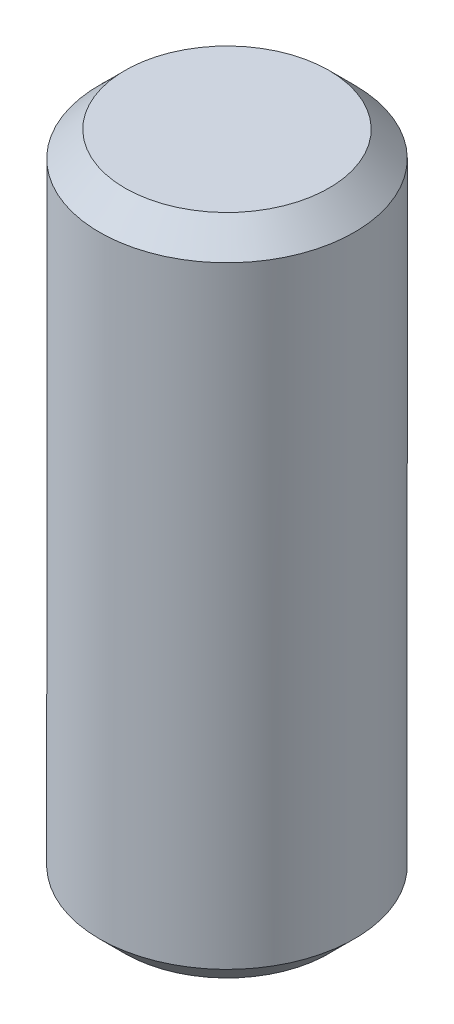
from build123d import *

# Parameters (mm, degrees)
SKETCH1_R           = 10
BOSS_EXTRUDE1_DEPTH = 52
CHAMFER1_SIZE       = 2


with BuildPart() as part:
    # Sketch1 → Boss-Extrude1 (new body)
    with BuildSketch(Plane(origin=(0, 0, 0), x_dir=(1, 0, 0), z_dir=(0, 1, 0))):
        with Locations(Location((0, 0, 0), (0, 0, 90))):
            Circle(SKETCH1_R)
    extrude(amount=BOSS_EXTRUDE1_DEPTH)

    # Chamfer1
    chamfer1_edges = [part.edges().sort_by_distance(p)[0] for p in [
        (0, 0, 10),
        (0, 52, 10),
    ]]
    chamfer(chamfer1_edges, length=CHAMFER1_SIZE)


solid = part.part
